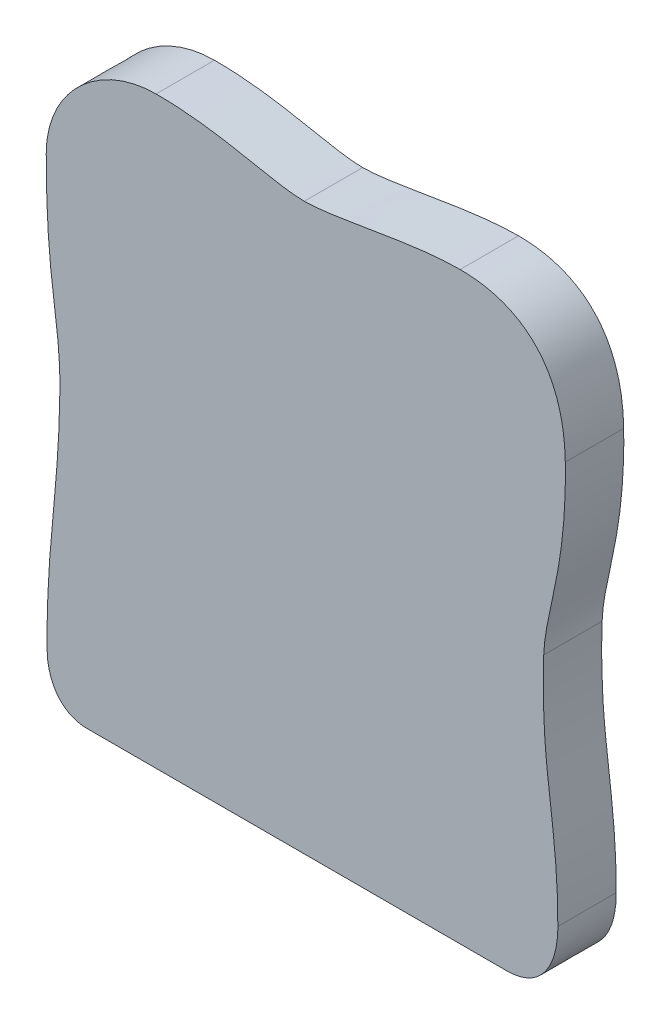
ISO-10303-21;
HEADER;
FILE_DESCRIPTION(('STEP AP214'),'2;1');
FILE_NAME('part.step','',(''),(''),'','','');
FILE_SCHEMA(('AUTOMOTIVE_DESIGN { 1 0 10303 214 1 1 1 1 }'));
ENDSEC;
DATA;
#1=APPLICATION_CONTEXT('core data for automotive mechanical design processes');
#2=APPLICATION_PROTOCOL_DEFINITION('international standard','automotive_design',2000,#1);
#3=PRODUCT_CONTEXT('',#1,'mechanical');
#4=PRODUCT('Part','Part','',(#3));
#5=PRODUCT_RELATED_PRODUCT_CATEGORY('part','',(#4));
#6=PRODUCT_DEFINITION_FORMATION('','',#4);
#7=PRODUCT_DEFINITION_CONTEXT('part definition',#1,'design');
#8=PRODUCT_DEFINITION('design','',#6,#7);
#9=PRODUCT_DEFINITION_SHAPE('','',#8);
#10=(LENGTH_UNIT() NAMED_UNIT(*) SI_UNIT(.MILLI.,.METRE.));
#11=(NAMED_UNIT(*) PLANE_ANGLE_UNIT() SI_UNIT($,.RADIAN.));
#12=(NAMED_UNIT(*) SI_UNIT($,.STERADIAN.) SOLID_ANGLE_UNIT());
#13=UNCERTAINTY_MEASURE_WITH_UNIT(LENGTH_MEASURE(1.E-05),#10,'distance_accuracy_value','');
#14=(GEOMETRIC_REPRESENTATION_CONTEXT(3) GLOBAL_UNCERTAINTY_ASSIGNED_CONTEXT((#13)) GLOBAL_UNIT_ASSIGNED_CONTEXT((#10,
#11,#12)) REPRESENTATION_CONTEXT('',''));
#15=CARTESIAN_POINT('',(0.,0.,0.));
#16=DIRECTION('',(0.,0.,1.));
#17=DIRECTION('',(1.,0.,0.));
#18=AXIS2_PLACEMENT_3D('',#15,#16,#17);
#19=CARTESIAN_POINT('',(30.8796,-45.0294,4.5));
#20=CARTESIAN_POINT('',(36.349,-45.0294,4.5));
#21=CARTESIAN_POINT('',(38.7984,-40.487,4.5));
#22=CARTESIAN_POINT('',(38.798,-35.1696,4.5));
#23=B_SPLINE_CURVE_WITH_KNOTS('',3,(#19,#20,#21,#22),.UNSPECIFIED.,.F.,.F.,(4,4),
(0.909090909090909,1.),.UNSPECIFIED.);
#24=DIRECTION('',(0.,0.,-1.));
#25=VECTOR('',#24,1.);
#26=SURFACE_OF_LINEAR_EXTRUSION('',#23,#25);
#27=CARTESIAN_POINT('',(30.8796,-45.0294,-4.5));
#28=CARTESIAN_POINT('',(36.349,-45.0294,-4.5));
#29=CARTESIAN_POINT('',(38.7984,-40.487,-4.5));
#30=CARTESIAN_POINT('',(38.798,-35.1696,-4.5));
#31=B_SPLINE_CURVE_WITH_KNOTS('',3,(#27,#28,#29,#30),.UNSPECIFIED.,.F.,.F.,(4,4),
(0.909090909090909,1.),.UNSPECIFIED.);
#32=CARTESIAN_POINT('',(30.8796,-45.0294,-4.5));
#33=VERTEX_POINT('',#32);
#34=CARTESIAN_POINT('',(38.798,-35.1696,-4.5));
#35=VERTEX_POINT('',#34);
#36=EDGE_CURVE('E287',#33,#35,#31,.T.);
#37=ORIENTED_EDGE('',*,*,#36,.T.);
#38=DIRECTION('',(0.,0.,-1.));
#39=VECTOR('',#38,1.);
#40=CARTESIAN_POINT('',(38.798,-35.1696,4.5));
#41=LINE('',#40,#39);
#42=CARTESIAN_POINT('',(38.798,-35.1696,4.5));
#43=VERTEX_POINT('',#42);
#44=EDGE_CURVE('E11',#43,#35,#41,.T.);
#45=ORIENTED_EDGE('',*,*,#44,.F.);
#46=CARTESIAN_POINT('',(30.8796,-45.0294,4.5));
#47=VERTEX_POINT('',#46);
#48=EDGE_CURVE('E263',#47,#43,#23,.T.);
#49=ORIENTED_EDGE('',*,*,#48,.F.);
#50=DIRECTION('',(0.,0.,-1.));
#51=VECTOR('',#50,1.);
#52=CARTESIAN_POINT('',(30.8796,-45.0294,4.5));
#53=LINE('',#52,#51);
#54=EDGE_CURVE('E175',#47,#33,#53,.T.);
#55=ORIENTED_EDGE('',*,*,#54,.T.);
#56=EDGE_LOOP('',(#37,#45,#49,#55));
#57=FACE_BOUND('',#56,.T.);
#58=ADVANCED_FACE('F53',(#57),#26,.F.);
#59=CARTESIAN_POINT('',(38.798,-35.1696,4.5));
#60=CARTESIAN_POINT('',(38.7977,-20.9047,4.5));
#61=CARTESIAN_POINT('',(36.0763,-15.728,4.5));
#62=CARTESIAN_POINT('',(36.6205,-0.0294,4.5));
#63=B_SPLINE_CURVE_WITH_KNOTS('',3,(#59,#60,#61,#62),.UNSPECIFIED.,.F.,.F.,(4,4),
(0.818181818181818,0.909090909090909),.UNSPECIFIED.);
#64=DIRECTION('',(0.,0.,-1.));
#65=VECTOR('',#64,1.);
#66=SURFACE_OF_LINEAR_EXTRUSION('',#63,#65);
#67=CARTESIAN_POINT('',(38.798,-35.1696,-4.5));
#68=CARTESIAN_POINT('',(38.7977,-20.9047,-4.5));
#69=CARTESIAN_POINT('',(36.0763,-15.728,-4.5));
#70=CARTESIAN_POINT('',(36.6205,-0.0294,-4.5));
#71=B_SPLINE_CURVE_WITH_KNOTS('',3,(#67,#68,#69,#70),.UNSPECIFIED.,.F.,.F.,(4,4),
(0.818181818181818,0.909090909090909),.UNSPECIFIED.);
#72=CARTESIAN_POINT('',(36.6205,-0.0294,-4.5));
#73=VERTEX_POINT('',#72);
#74=EDGE_CURVE('E278',#35,#73,#71,.T.);
#75=ORIENTED_EDGE('',*,*,#74,.T.);
#76=DIRECTION('',(0.,0.,-1.));
#77=VECTOR('',#76,1.);
#78=CARTESIAN_POINT('',(36.6205,-0.0294,4.5));
#79=LINE('',#78,#77);
#80=CARTESIAN_POINT('',(36.6205,-0.0294,4.5));
#81=VERTEX_POINT('',#80);
#82=EDGE_CURVE('E63',#81,#73,#79,.T.);
#83=ORIENTED_EDGE('',*,*,#82,.F.);
#84=EDGE_CURVE('E129',#43,#81,#63,.T.);
#85=ORIENTED_EDGE('',*,*,#84,.F.);
#86=ORIENTED_EDGE('',*,*,#44,.T.);
#87=EDGE_LOOP('',(#75,#83,#85,#86));
#88=FACE_BOUND('',#87,.T.);
#89=ADVANCED_FACE('F270',(#88),#66,.F.);
#90=CARTESIAN_POINT('',(36.6205,-0.0294,4.5));
#91=CARTESIAN_POINT('',(36.8437,6.4049,4.5));
#92=CARTESIAN_POINT('',(40.1924,12.6092,4.5));
#93=CARTESIAN_POINT('',(39.9479,27.3744,4.5));
#94=B_SPLINE_CURVE_WITH_KNOTS('',3,(#90,#91,#92,#93),.UNSPECIFIED.,.F.,.F.,(4,4),
(0.727272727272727,0.818181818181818),.UNSPECIFIED.);
#95=DIRECTION('',(0.,0.,-1.));
#96=VECTOR('',#95,1.);
#97=SURFACE_OF_LINEAR_EXTRUSION('',#94,#96);
#98=CARTESIAN_POINT('',(36.6205,-0.0294,-4.5));
#99=CARTESIAN_POINT('',(36.8437,6.4049,-4.5));
#100=CARTESIAN_POINT('',(40.1924,12.6092,-4.5));
#101=CARTESIAN_POINT('',(39.9479,27.3744,-4.5));
#102=B_SPLINE_CURVE_WITH_KNOTS('',3,(#98,#99,#100,#101),.UNSPECIFIED.,.F.,.F.,(4,4),
(0.727272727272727,0.818181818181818),.UNSPECIFIED.);
#103=CARTESIAN_POINT('',(39.9479,27.3744,-4.5));
#104=VERTEX_POINT('',#103);
#105=EDGE_CURVE('E286',#73,#104,#102,.T.);
#106=ORIENTED_EDGE('',*,*,#105,.T.);
#107=DIRECTION('',(0.,0.,-1.));
#108=VECTOR('',#107,1.);
#109=CARTESIAN_POINT('',(39.9479,27.3744,4.5));
#110=LINE('',#109,#108);
#111=CARTESIAN_POINT('',(39.9479,27.3744,4.5));
#112=VERTEX_POINT('',#111);
#113=EDGE_CURVE('E291',#112,#104,#110,.T.);
#114=ORIENTED_EDGE('',*,*,#113,.F.);
#115=EDGE_CURVE('E248',#81,#112,#94,.T.);
#116=ORIENTED_EDGE('',*,*,#115,.F.);
#117=ORIENTED_EDGE('',*,*,#82,.T.);
#118=EDGE_LOOP('',(#106,#114,#116,#117));
#119=FACE_BOUND('',#118,.T.);
#120=ADVANCED_FACE('F241',(#119),#97,.F.);
#121=CARTESIAN_POINT('',(39.9479,27.3744,4.5));
#122=CARTESIAN_POINT('',(39.7472,39.5121,4.5));
#123=CARTESIAN_POINT('',(33.1735,44.9798,4.5));
#124=CARTESIAN_POINT('',(23.7397,44.9706,4.5));
#125=B_SPLINE_CURVE_WITH_KNOTS('',3,(#121,#122,#123,#124),.UNSPECIFIED.,.F.,.F.,(4,4),
(0.636363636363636,0.727272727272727),.UNSPECIFIED.);
#126=DIRECTION('',(0.,0.,-1.));
#127=VECTOR('',#126,1.);
#128=SURFACE_OF_LINEAR_EXTRUSION('',#125,#127);
#129=CARTESIAN_POINT('',(39.9479,27.3744,-4.5));
#130=CARTESIAN_POINT('',(39.7472,39.5121,-4.5));
#131=CARTESIAN_POINT('',(33.1735,44.9798,-4.5));
#132=CARTESIAN_POINT('',(23.7397,44.9706,-4.5));
#133=B_SPLINE_CURVE_WITH_KNOTS('',3,(#129,#130,#131,#132),.UNSPECIFIED.,.F.,.F.,(4,4),
(0.636363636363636,0.727272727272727),.UNSPECIFIED.);
#134=CARTESIAN_POINT('',(23.7397,44.9706,-4.5));
#135=VERTEX_POINT('',#134);
#136=EDGE_CURVE('E295',#104,#135,#133,.T.);
#137=ORIENTED_EDGE('',*,*,#136,.T.);
#138=DIRECTION('',(0.,0.,-1.));
#139=VECTOR('',#138,1.);
#140=CARTESIAN_POINT('',(23.7397,44.9706,4.5));
#141=LINE('',#140,#139);
#142=CARTESIAN_POINT('',(23.7397,44.9706,4.5));
#143=VERTEX_POINT('',#142);
#144=EDGE_CURVE('E368',#143,#135,#141,.T.);
#145=ORIENTED_EDGE('',*,*,#144,.F.);
#146=EDGE_CURVE('E244',#112,#143,#125,.T.);
#147=ORIENTED_EDGE('',*,*,#146,.F.);
#148=ORIENTED_EDGE('',*,*,#113,.T.);
#149=EDGE_LOOP('',(#137,#145,#147,#148));
#150=FACE_BOUND('',#149,.T.);
#151=ADVANCED_FACE('F237',(#150),#128,.F.);
#152=CARTESIAN_POINT('',(23.7397,44.9706,4.5));
#153=CARTESIAN_POINT('',(15.9342,44.9632,4.5));
#154=CARTESIAN_POINT('',(4.6899,42.0662,4.5));
#155=CARTESIAN_POINT('',(-0.2786,42.0662,4.5));
#156=B_SPLINE_CURVE_WITH_KNOTS('',3,(#152,#153,#154,#155),.UNSPECIFIED.,.F.,.F.,(4,4),
(0.545454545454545,0.636363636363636),.UNSPECIFIED.);
#157=DIRECTION('',(0.,0.,-1.));
#158=VECTOR('',#157,1.);
#159=SURFACE_OF_LINEAR_EXTRUSION('',#156,#158);
#160=CARTESIAN_POINT('',(23.7397,44.9706,-4.5));
#161=CARTESIAN_POINT('',(15.9342,44.9632,-4.5));
#162=CARTESIAN_POINT('',(4.6899,42.0662,-4.5));
#163=CARTESIAN_POINT('',(-0.2786,42.0662,-4.5));
#164=B_SPLINE_CURVE_WITH_KNOTS('',3,(#160,#161,#162,#163),.UNSPECIFIED.,.F.,.F.,(4,4),
(0.545454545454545,0.636363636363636),.UNSPECIFIED.);
#165=CARTESIAN_POINT('',(-0.2786,42.0662,-4.5));
#166=VERTEX_POINT('',#165);
#167=EDGE_CURVE('E297',#135,#166,#164,.T.);
#168=ORIENTED_EDGE('',*,*,#167,.T.);
#169=DIRECTION('',(0.,0.,-1.));
#170=VECTOR('',#169,1.);
#171=CARTESIAN_POINT('',(-0.2786,42.0662,4.5));
#172=LINE('',#171,#170);
#173=CARTESIAN_POINT('',(-0.2786,42.0662,4.5));
#174=VERTEX_POINT('',#173);
#175=EDGE_CURVE('E365',#174,#166,#172,.T.);
#176=ORIENTED_EDGE('',*,*,#175,.F.);
#177=EDGE_CURVE('E222',#143,#174,#156,.T.);
#178=ORIENTED_EDGE('',*,*,#177,.F.);
#179=ORIENTED_EDGE('',*,*,#144,.T.);
#180=EDGE_LOOP('',(#168,#176,#178,#179));
#181=FACE_BOUND('',#180,.T.);
#182=ADVANCED_FACE('F233',(#181),#159,.F.);
#183=CARTESIAN_POINT('',(-0.2786,42.0662,4.5));
#184=CARTESIAN_POINT('',(-5.2472,42.0662,4.5));
#185=CARTESIAN_POINT('',(-12.9085,44.9868,4.5));
#186=CARTESIAN_POINT('',(-23.1146,44.9706,4.5));
#187=B_SPLINE_CURVE_WITH_KNOTS('',3,(#183,#184,#185,#186),.UNSPECIFIED.,.F.,.F.,(4,4),
(0.454545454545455,0.545454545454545),.UNSPECIFIED.);
#188=DIRECTION('',(0.,0.,-1.));
#189=VECTOR('',#188,1.);
#190=SURFACE_OF_LINEAR_EXTRUSION('',#187,#189);
#191=CARTESIAN_POINT('',(-0.2786,42.0662,-4.5));
#192=CARTESIAN_POINT('',(-5.2472,42.0662,-4.5));
#193=CARTESIAN_POINT('',(-12.9085,44.9868,-4.5));
#194=CARTESIAN_POINT('',(-23.1146,44.9706,-4.5));
#195=B_SPLINE_CURVE_WITH_KNOTS('',3,(#191,#192,#193,#194),.UNSPECIFIED.,.F.,.F.,(4,4),
(0.454545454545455,0.545454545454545),.UNSPECIFIED.);
#196=CARTESIAN_POINT('',(-23.1146,44.9706,-4.5));
#197=VERTEX_POINT('',#196);
#198=EDGE_CURVE('E315',#166,#197,#195,.T.);
#199=ORIENTED_EDGE('',*,*,#198,.T.);
#200=DIRECTION('',(0.,0.,-1.));
#201=VECTOR('',#200,1.);
#202=CARTESIAN_POINT('',(-23.1146,44.9706,4.5));
#203=LINE('',#202,#201);
#204=CARTESIAN_POINT('',(-23.1146,44.9706,4.5));
#205=VERTEX_POINT('',#204);
#206=EDGE_CURVE('E362',#205,#197,#203,.T.);
#207=ORIENTED_EDGE('',*,*,#206,.F.);
#208=EDGE_CURVE('E214',#174,#205,#187,.T.);
#209=ORIENTED_EDGE('',*,*,#208,.F.);
#210=ORIENTED_EDGE('',*,*,#175,.T.);
#211=EDGE_LOOP('',(#199,#207,#209,#210));
#212=FACE_BOUND('',#211,.T.);
#213=ADVANCED_FACE('F230',(#212),#190,.F.);
#214=CARTESIAN_POINT('',(-23.1146,44.9706,4.5));
#215=CARTESIAN_POINT('',(-31.874,44.9565,4.5));
#216=CARTESIAN_POINT('',(-40.0393,37.5714,4.5));
#217=CARTESIAN_POINT('',(-40.0393,28.5283,4.5));
#218=B_SPLINE_CURVE_WITH_KNOTS('',3,(#214,#215,#216,#217),.UNSPECIFIED.,.F.,.F.,(4,4),
(0.363636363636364,0.454545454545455),.UNSPECIFIED.);
#219=DIRECTION('',(0.,0.,-1.));
#220=VECTOR('',#219,1.);
#221=SURFACE_OF_LINEAR_EXTRUSION('',#218,#220);
#222=CARTESIAN_POINT('',(-23.1146,44.9706,-4.5));
#223=CARTESIAN_POINT('',(-31.874,44.9565,-4.5));
#224=CARTESIAN_POINT('',(-40.0393,37.5714,-4.5));
#225=CARTESIAN_POINT('',(-40.0393,28.5283,-4.5));
#226=B_SPLINE_CURVE_WITH_KNOTS('',3,(#222,#223,#224,#225),.UNSPECIFIED.,.F.,.F.,(4,4),
(0.363636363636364,0.454545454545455),.UNSPECIFIED.);
#227=CARTESIAN_POINT('',(-40.0393,28.5283,-4.5));
#228=VERTEX_POINT('',#227);
#229=EDGE_CURVE('E322',#197,#228,#226,.T.);
#230=ORIENTED_EDGE('',*,*,#229,.T.);
#231=DIRECTION('',(0.,0.,-1.));
#232=VECTOR('',#231,1.);
#233=CARTESIAN_POINT('',(-40.0393,28.5283,4.5));
#234=LINE('',#233,#232);
#235=CARTESIAN_POINT('',(-40.0393,28.5283,4.5));
#236=VERTEX_POINT('',#235);
#237=EDGE_CURVE('E359',#236,#228,#234,.T.);
#238=ORIENTED_EDGE('',*,*,#237,.F.);
#239=EDGE_CURVE('E206',#205,#236,#218,.T.);
#240=ORIENTED_EDGE('',*,*,#239,.F.);
#241=ORIENTED_EDGE('',*,*,#206,.T.);
#242=EDGE_LOOP('',(#230,#238,#240,#241));
#243=FACE_BOUND('',#242,.T.);
#244=ADVANCED_FACE('F199',(#243),#221,.F.);
#245=CARTESIAN_POINT('',(-40.0393,28.5283,4.5));
#246=CARTESIAN_POINT('',(-40.0393,10.4926,4.5));
#247=CARTESIAN_POINT('',(-37.8092,7.9617,4.5));
#248=CARTESIAN_POINT('',(-37.939,-2.2074,4.5));
#249=B_SPLINE_CURVE_WITH_KNOTS('',3,(#245,#246,#247,#248),.UNSPECIFIED.,.F.,.F.,(4,4),
(0.272727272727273,0.363636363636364),.UNSPECIFIED.);
#250=DIRECTION('',(0.,0.,-1.));
#251=VECTOR('',#250,1.);
#252=SURFACE_OF_LINEAR_EXTRUSION('',#249,#251);
#253=CARTESIAN_POINT('',(-40.0393,28.5283,-4.5));
#254=CARTESIAN_POINT('',(-40.0393,10.4926,-4.5));
#255=CARTESIAN_POINT('',(-37.8092,7.9617,-4.5));
#256=CARTESIAN_POINT('',(-37.939,-2.2074,-4.5));
#257=B_SPLINE_CURVE_WITH_KNOTS('',3,(#253,#254,#255,#256),.UNSPECIFIED.,.F.,.F.,(4,4),
(0.272727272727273,0.363636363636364),.UNSPECIFIED.);
#258=CARTESIAN_POINT('',(-37.939,-2.2074,-4.5));
#259=VERTEX_POINT('',#258);
#260=EDGE_CURVE('E329',#228,#259,#257,.T.);
#261=ORIENTED_EDGE('',*,*,#260,.T.);
#262=DIRECTION('',(0.,0.,-1.));
#263=VECTOR('',#262,1.);
#264=CARTESIAN_POINT('',(-37.939,-2.2074,4.5));
#265=LINE('',#264,#263);
#266=CARTESIAN_POINT('',(-37.939,-2.2074,4.5));
#267=VERTEX_POINT('',#266);
#268=EDGE_CURVE('E168',#267,#259,#265,.T.);
#269=ORIENTED_EDGE('',*,*,#268,.F.);
#270=EDGE_CURVE('E157',#236,#267,#249,.T.);
#271=ORIENTED_EDGE('',*,*,#270,.F.);
#272=ORIENTED_EDGE('',*,*,#237,.T.);
#273=EDGE_LOOP('',(#261,#269,#271,#272));
#274=FACE_BOUND('',#273,.T.);
#275=ADVANCED_FACE('F196',(#274),#252,.F.);
#276=CARTESIAN_POINT('',(-37.939,-2.2074,4.5));
#277=CARTESIAN_POINT('',(-38.1191,-16.3179,4.5));
#278=CARTESIAN_POINT('',(-40.0393,-23.0213,4.5));
#279=CARTESIAN_POINT('',(-39.8965,-37.6616,4.5));
#280=B_SPLINE_CURVE_WITH_KNOTS('',3,(#276,#277,#278,#279),.UNSPECIFIED.,.F.,.F.,(4,4),
(0.181818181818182,0.272727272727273),.UNSPECIFIED.);
#281=DIRECTION('',(0.,0.,-1.));
#282=VECTOR('',#281,1.);
#283=SURFACE_OF_LINEAR_EXTRUSION('',#280,#282);
#284=CARTESIAN_POINT('',(-37.939,-2.2074,-4.5));
#285=CARTESIAN_POINT('',(-38.1191,-16.3179,-4.5));
#286=CARTESIAN_POINT('',(-40.0393,-23.0213,-4.5));
#287=CARTESIAN_POINT('',(-39.8965,-37.6616,-4.5));
#288=B_SPLINE_CURVE_WITH_KNOTS('',3,(#284,#285,#286,#287),.UNSPECIFIED.,.F.,.F.,(4,4),
(0.181818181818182,0.272727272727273),.UNSPECIFIED.);
#289=CARTESIAN_POINT('',(-39.8965,-37.6616,-4.5));
#290=VERTEX_POINT('',#289);
#291=EDGE_CURVE('E166',#259,#290,#288,.T.);
#292=ORIENTED_EDGE('',*,*,#291,.T.);
#293=DIRECTION('',(0.,0.,-1.));
#294=VECTOR('',#293,1.);
#295=CARTESIAN_POINT('',(-39.8965,-37.6616,4.5));
#296=LINE('',#295,#294);
#297=CARTESIAN_POINT('',(-39.8965,-37.6616,4.5));
#298=VERTEX_POINT('',#297);
#299=EDGE_CURVE('E163',#298,#290,#296,.T.);
#300=ORIENTED_EDGE('',*,*,#299,.F.);
#301=EDGE_CURVE('E151',#267,#298,#280,.T.);
#302=ORIENTED_EDGE('',*,*,#301,.F.);
#303=ORIENTED_EDGE('',*,*,#268,.T.);
#304=EDGE_LOOP('',(#292,#300,#302,#303));
#305=FACE_BOUND('',#304,.T.);
#306=ADVANCED_FACE('F164',(#305),#283,.F.);
#307=CARTESIAN_POINT('',(-39.8965,-37.6616,4.5));
#308=CARTESIAN_POINT('',(-39.8581,-41.5785,4.5));
#309=CARTESIAN_POINT('',(-37.7807,-45.0294,4.5));
#310=CARTESIAN_POINT('',(-33.7517,-45.0294,4.5));
#311=B_SPLINE_CURVE_WITH_KNOTS('',3,(#307,#308,#309,#310),.UNSPECIFIED.,.F.,.F.,(4,4),
(0.0909090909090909,0.181818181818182),.UNSPECIFIED.);
#312=DIRECTION('',(0.,0.,-1.));
#313=VECTOR('',#312,1.);
#314=SURFACE_OF_LINEAR_EXTRUSION('',#311,#313);
#315=CARTESIAN_POINT('',(-39.8965,-37.6616,-4.5));
#316=CARTESIAN_POINT('',(-39.8581,-41.5785,-4.5));
#317=CARTESIAN_POINT('',(-37.7807,-45.0294,-4.5));
#318=CARTESIAN_POINT('',(-33.7517,-45.0294,-4.5));
#319=B_SPLINE_CURVE_WITH_KNOTS('',3,(#315,#316,#317,#318),.UNSPECIFIED.,.F.,.F.,(4,4),
(0.0909090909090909,0.181818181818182),.UNSPECIFIED.);
#320=CARTESIAN_POINT('',(-33.7517,-45.0294,-4.5));
#321=VERTEX_POINT('',#320);
#322=EDGE_CURVE('E114',#290,#321,#319,.T.);
#323=ORIENTED_EDGE('',*,*,#322,.T.);
#324=DIRECTION('',(0.,0.,-1.));
#325=VECTOR('',#324,1.);
#326=CARTESIAN_POINT('',(-33.7517,-45.0294,4.5));
#327=LINE('',#326,#325);
#328=CARTESIAN_POINT('',(-33.7517,-45.0294,4.5));
#329=VERTEX_POINT('',#328);
#330=EDGE_CURVE('E169',#329,#321,#327,.T.);
#331=ORIENTED_EDGE('',*,*,#330,.F.);
#332=EDGE_CURVE('E155',#298,#329,#311,.T.);
#333=ORIENTED_EDGE('',*,*,#332,.F.);
#334=ORIENTED_EDGE('',*,*,#299,.T.);
#335=EDGE_LOOP('',(#323,#331,#333,#334));
#336=FACE_BOUND('',#335,.T.);
#337=ADVANCED_FACE('F171',(#336),#314,.F.);
#338=CARTESIAN_POINT('',(30.8796,-45.0294,4.5));
#339=DIRECTION('',(0.,1.,0.));
#340=DIRECTION('',(0.,0.,1.));
#341=AXIS2_PLACEMENT_3D('',#338,#339,#340);
#342=PLANE('',#341);
#343=DIRECTION('',(1.,0.,0.));
#344=VECTOR('',#343,1.);
#345=CARTESIAN_POINT('',(30.8796,-45.0294,-4.5));
#346=LINE('',#345,#344);
#347=EDGE_CURVE('E120',#321,#33,#346,.T.);
#348=ORIENTED_EDGE('',*,*,#347,.T.);
#349=ORIENTED_EDGE('',*,*,#54,.F.);
#350=DIRECTION('',(1.,0.,0.));
#351=VECTOR('',#350,1.);
#352=CARTESIAN_POINT('',(30.8796,-45.0294,4.5));
#353=LINE('',#352,#351);
#354=EDGE_CURVE('E74',#329,#47,#353,.T.);
#355=ORIENTED_EDGE('',*,*,#354,.F.);
#356=ORIENTED_EDGE('',*,*,#330,.T.);
#357=EDGE_LOOP('',(#348,#349,#355,#356));
#358=FACE_BOUND('',#357,.T.);
#359=ADVANCED_FACE('F192',(#358),#342,.F.);
#360=CARTESIAN_POINT('',(36.889975,-42.093525,4.5));
#361=DIRECTION('',(0.,0.,1.));
#362=DIRECTION('',(1.,0.,0.));
#363=AXIS2_PLACEMENT_3D('',#360,#361,#362);
#364=PLANE('',#363);
#365=ORIENTED_EDGE('',*,*,#48,.T.);
#366=ORIENTED_EDGE('',*,*,#84,.T.);
#367=ORIENTED_EDGE('',*,*,#115,.T.);
#368=ORIENTED_EDGE('',*,*,#146,.T.);
#369=ORIENTED_EDGE('',*,*,#177,.T.);
#370=ORIENTED_EDGE('',*,*,#208,.T.);
#371=ORIENTED_EDGE('',*,*,#239,.T.);
#372=ORIENTED_EDGE('',*,*,#270,.T.);
#373=ORIENTED_EDGE('',*,*,#301,.T.);
#374=ORIENTED_EDGE('',*,*,#332,.T.);
#375=ORIENTED_EDGE('',*,*,#354,.T.);
#376=EDGE_LOOP('',(#365,#366,#367,#368,#369,#370,#371,#372,#373,#374,#375));
#377=FACE_BOUND('',#376,.T.);
#378=ADVANCED_FACE('F153',(#377),#364,.T.);
#379=CARTESIAN_POINT('',(36.889975,-42.093525,-4.5));
#380=DIRECTION('',(0.,0.,1.));
#381=DIRECTION('',(1.,0.,0.));
#382=AXIS2_PLACEMENT_3D('',#379,#380,#381);
#383=PLANE('',#382);
#384=ORIENTED_EDGE('',*,*,#36,.F.);
#385=ORIENTED_EDGE('',*,*,#347,.F.);
#386=ORIENTED_EDGE('',*,*,#322,.F.);
#387=ORIENTED_EDGE('',*,*,#291,.F.);
#388=ORIENTED_EDGE('',*,*,#260,.F.);
#389=ORIENTED_EDGE('',*,*,#229,.F.);
#390=ORIENTED_EDGE('',*,*,#198,.F.);
#391=ORIENTED_EDGE('',*,*,#167,.F.);
#392=ORIENTED_EDGE('',*,*,#136,.F.);
#393=ORIENTED_EDGE('',*,*,#105,.F.);
#394=ORIENTED_EDGE('',*,*,#74,.F.);
#395=EDGE_LOOP('',(#384,#385,#386,#387,#388,#389,#390,#391,#392,#393,#394));
#396=FACE_BOUND('',#395,.T.);
#397=ADVANCED_FACE('F293',(#396),#383,.F.);
#398=CLOSED_SHELL('',(#58,#89,#120,#151,#182,#213,#244,#275,#306,#337,#359,#378,#397));
#399=MANIFOLD_SOLID_BREP('B2',#398);
#400=ADVANCED_BREP_SHAPE_REPRESENTATION('',(#18,#399),#14);
#401=SHAPE_DEFINITION_REPRESENTATION(#9,#400);
ENDSEC;
END-ISO-10303-21;
